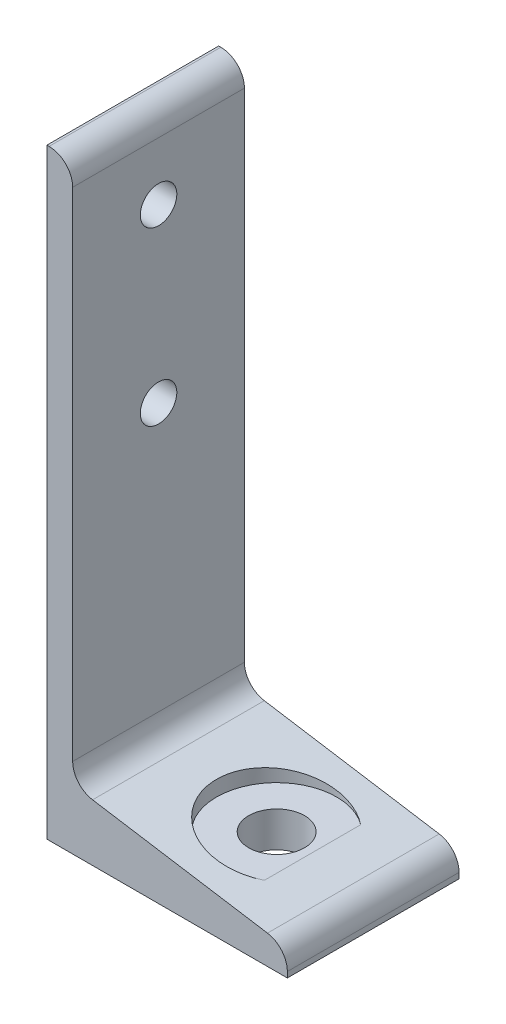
from build123d import *

# Parameters (mm, degrees)
EXTRUDE_1_DEPTH     = 20
SKETCH_2_R          = 4.25
CUT_EXTRUDE_1_DEPTH = 30
SKETCH_3_R          = 6.5
CUT_EXTRUDE_2_DEPTH = 30
SKETCH_4_R          = 14
CUT_EXTRUDE_3_DEPTH = 5


with BuildPart() as part:
    # Sketch 1 → Extrude 1 (new, symmetric)
    with BuildSketch(Plane.XY):
        with BuildLine():
            Line((0, 0), (0, -140))
            Line((0, -140), (56, -140))
            Line((56, -140), (56, -138.689955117))
            ThreePointArc((56, -138.689955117), (54.685045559, -135.121286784), (51.368947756, -133.259031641))
            Line((51.368947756, -133.259031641), (10.631052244, -126.740968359))
            ThreePointArc((10.631052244, -126.740968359), (7.314954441, -124.878713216), (6, -121.310044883))
            Line((6, -121.310044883), (6, -5.5))
            ThreePointArc((6, -5.5), (4.389087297, -1.610912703), (0.5, 0))
            Line((0.5, 0), (0, 0))
        make_face()
    extrude(amount=EXTRUDE_1_DEPTH, both=True)

    # Sketch 2 → Cut-Extrude 1 (cut)
    with BuildSketch(Plane.ZY):
        with Locations((0, -19)):
            Circle(SKETCH_2_R)
        with Locations((0, -59)):
            Circle(SKETCH_2_R)
    extrude(amount=-CUT_EXTRUDE_1_DEPTH, mode=Mode.SUBTRACT)

    # Sketch 3 → Cut-Extrude 2 (cut)
    with BuildSketch(Plane.XZ.offset(140)):
        with Locations(Location((33.5, 0, 0), (0, 0, 270))):
            Circle(SKETCH_3_R)
    extrude(amount=-CUT_EXTRUDE_2_DEPTH, mode=Mode.SUBTRACT)

    # Sketch 4 → Cut-Extrude 3 (cut)
    with BuildSketch(Plane(origin=(0, -126.740968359, 0), x_dir=(-1, 0, 0), z_dir=(0, -1, 0))):
        with Locations((-33.5, 0)):
            Circle(SKETCH_4_R)
    extrude(amount=CUT_EXTRUDE_3_DEPTH, mode=Mode.SUBTRACT)


solid = part.part
